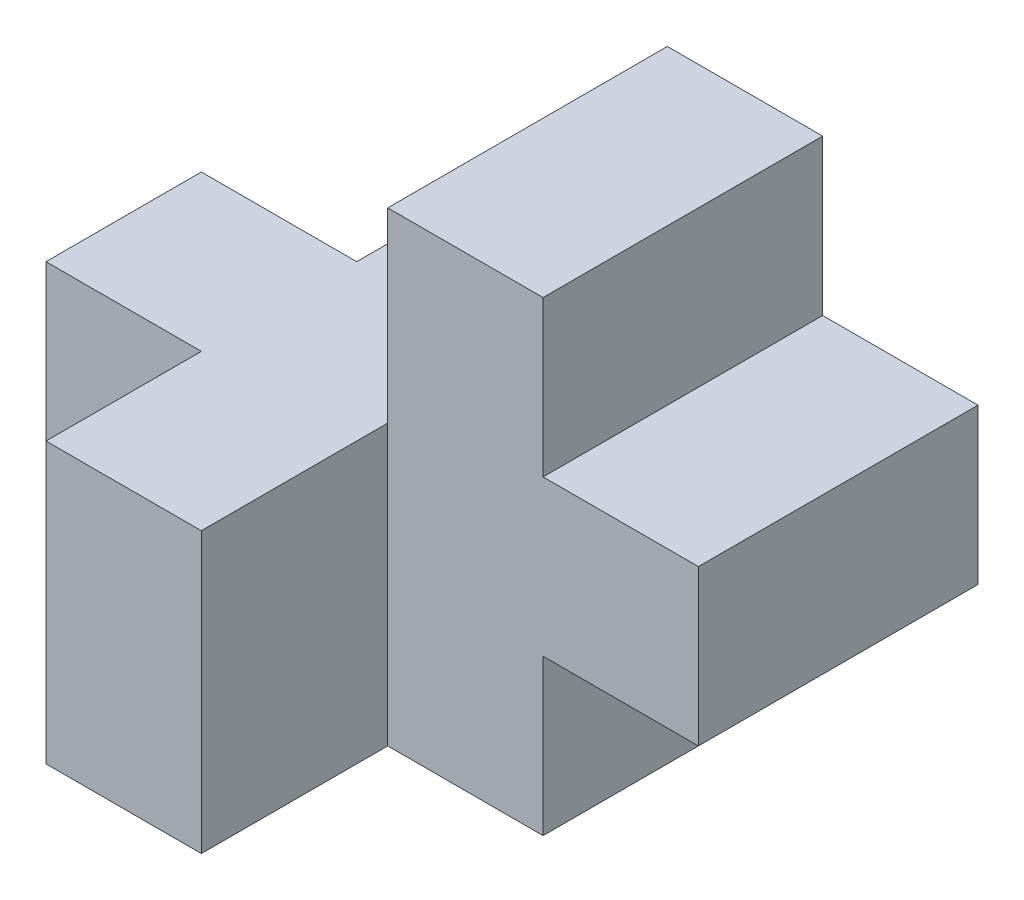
from build123d import *

# Parameters (mm, degrees)
EXTRUDE_1_DEPTH = 90
EXTRUDE_2_DEPTH = 90


with BuildPart() as part:
    # Sketch 1 → Extrude 1 (new body)
    with BuildSketch(Plane.XY):
        Polygon((0, 0), (0, 75), (50, 75), (50, 25), (100, 25), (100, -25), (50, -25), (50, -75), (0, -75), align=None)
    extrude(amount=-EXTRUDE_1_DEPTH)

    # Sketch 2 → Extrude 2 (add)
    with BuildSketch(Plane.XZ.offset(75)):
        Polygon((0, -90), (-50, -90), (-50, -40), (-100, -40), (-100, 10), (-50, 10), (-50, 60), (0, 60), align=None)
    extrude(amount=-EXTRUDE_2_DEPTH)


solid = part.part
